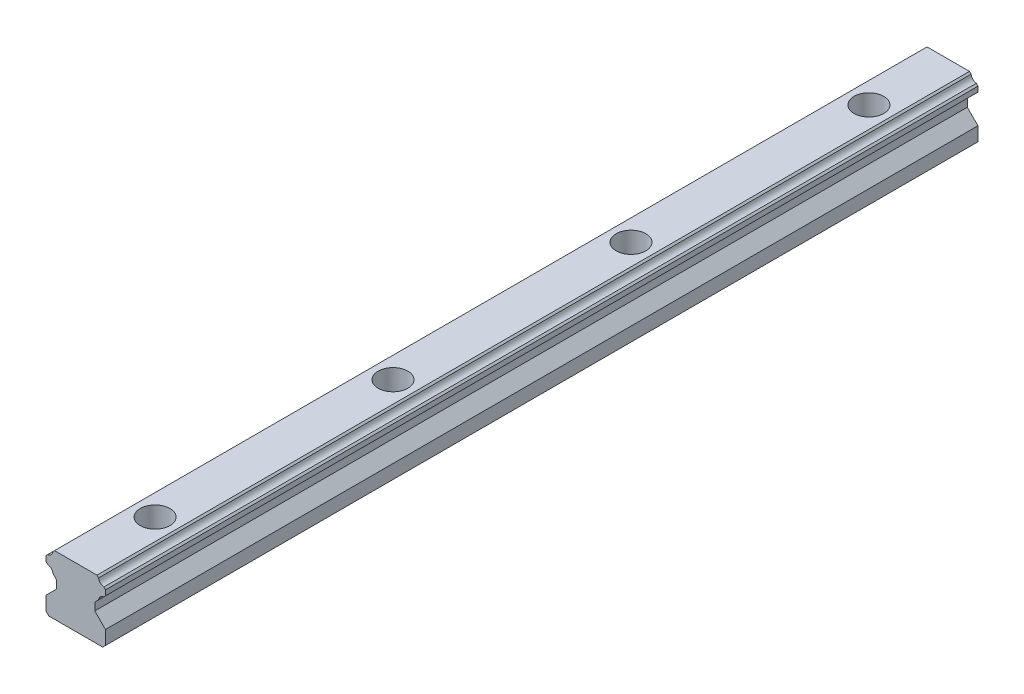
from build123d import *

# Parameters (mm, degrees)
BOSS_EXTRUDE1_DEPTH                                 = 110
CBORE_FOR_M4_HEX_SOCKET_HEAD_CAP_SCREW1_D           = 4.5
CBORE_FOR_M4_HEX_SOCKET_HEAD_CAP_SCREW1_CBORE_D     = 7.5
CBORE_FOR_M4_HEX_SOCKET_HEAD_CAP_SCREW1_CBORE_DEPTH = 5.3
LPATTERN1_COUNT                                     = 4
LPATTERN1_PITCH                                     = 60


with BuildPart() as part:
    # Sketch2 → Boss-Extrude1 (new, symmetric)
    with BuildSketch(Plane.XY):
        with BuildLine():
            Line((-4.8000183, 8.8400054), (-4.8000183, 6.9000063))
            Line((-4.8000183, 6.9000063), (-7.5, 4.2000246))
            Line((-7.5, 4.2000246), (-7.5, 0.69999271))
            Line((-7.5, 0.69999271), (-6.800007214, 0))
            Line((-6.800007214, 0), (6.800007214, 0))
            Line((6.800007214, 0), (7.5, 0.69999271))
            Line((7.5, 0.69999271), (7.5, 4.2000246))
            Line((7.5, 4.2000246), (4.8000183, 6.9000063))
            Line((4.8000183, 6.9000063), (4.8000183, 8.8400054))
            Line((4.8000183, 8.8400054), (5.754192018, 9.794179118))
            ThreePointArc((5.754192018, 9.794179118), (6.19742038, 10.691084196), (7.09432569, 11.13431209))
            Line((7.09432569, 11.13431209), (7.5, 11.5399866))
            Line((7.5, 11.5399866), (7.5, 12.8500204))
            Line((7.5, 12.8500204), (7.081576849, 13.268442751))
            ThreePointArc((7.081576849, 13.268442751), (6.197423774, 13.70991381), (5.755946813, 14.594063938))
            Line((5.755946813, 14.594063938), (5.3500197, 15))
            Line((5.3500197, 15), (-5.3500197, 15))
            Line((-5.3500197, 15), (-5.755946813, 14.594063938))
            ThreePointArc((-5.755946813, 14.594063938), (-6.197423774, 13.70991381), (-7.081576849, 13.268442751))
            Line((-7.081576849, 13.268442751), (-7.5, 12.8500204))
            Line((-7.5, 12.8500204), (-7.5, 11.5399866))
            Line((-7.5, 11.5399866), (-7.09432569, 11.13431209))
            ThreePointArc((-7.09432569, 11.13431209), (-6.19742038, 10.691084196), (-5.754192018, 9.794179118))
            Line((-5.754192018, 9.794179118), (-4.8000183, 8.8400054))
        make_face()
    extrude(amount=BOSS_EXTRUDE1_DEPTH, both=True)

    # CBORE for M4 Hex Socket Head Cap Screw1 (through all)
    with Locations(Plane(origin=(0, 15, 0), x_dir=(1, 0, 0), z_dir=(0, 1, 0))):
        with Locations((0, -90)):
            cbore_for_m4_hex_socket_head_cap_screw1 = CounterBoreHole(CBORE_FOR_M4_HEX_SOCKET_HEAD_CAP_SCREW1_D / 2, CBORE_FOR_M4_HEX_SOCKET_HEAD_CAP_SCREW1_CBORE_D / 2, CBORE_FOR_M4_HEX_SOCKET_HEAD_CAP_SCREW1_CBORE_DEPTH)

    # LPattern1: CBORE for M4 Hex Socket Head Cap Screw1 ×4
    with Locations(*[(0, 0, -i * LPATTERN1_PITCH) for i in range(1, LPATTERN1_COUNT)]):
        add(cbore_for_m4_hex_socket_head_cap_screw1, mode=Mode.SUBTRACT)


solid = part.part
